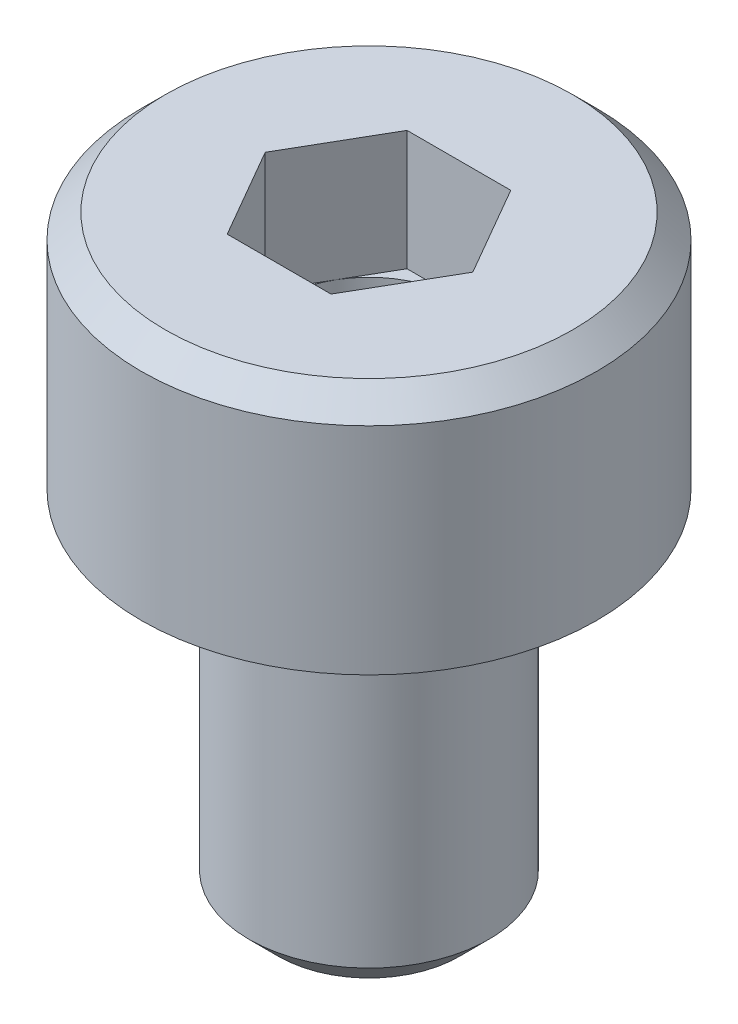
ISO-10303-21;
HEADER;
FILE_DESCRIPTION(('STEP AP214'),'2;1');
FILE_NAME('part.step','',(''),(''),'','','');
FILE_SCHEMA(('AUTOMOTIVE_DESIGN { 1 0 10303 214 1 1 1 1 }'));
ENDSEC;
DATA;
#1=APPLICATION_CONTEXT('core data for automotive mechanical design processes');
#2=APPLICATION_PROTOCOL_DEFINITION('international standard','automotive_design',2000,#1);
#3=PRODUCT_CONTEXT('',#1,'mechanical');
#4=PRODUCT('Part','Part','',(#3));
#5=PRODUCT_RELATED_PRODUCT_CATEGORY('part','',(#4));
#6=PRODUCT_DEFINITION_FORMATION('','',#4);
#7=PRODUCT_DEFINITION_CONTEXT('part definition',#1,'design');
#8=PRODUCT_DEFINITION('design','',#6,#7);
#9=PRODUCT_DEFINITION_SHAPE('','',#8);
#10=(LENGTH_UNIT() NAMED_UNIT(*) SI_UNIT(.MILLI.,.METRE.));
#11=(NAMED_UNIT(*) PLANE_ANGLE_UNIT() SI_UNIT($,.RADIAN.));
#12=(NAMED_UNIT(*) SI_UNIT($,.STERADIAN.) SOLID_ANGLE_UNIT());
#13=UNCERTAINTY_MEASURE_WITH_UNIT(LENGTH_MEASURE(1.E-05),#10,'distance_accuracy_value','');
#14=(GEOMETRIC_REPRESENTATION_CONTEXT(3) GLOBAL_UNCERTAINTY_ASSIGNED_CONTEXT((#13)) GLOBAL_UNIT_ASSIGNED_CONTEXT((#10,
#11,#12)) REPRESENTATION_CONTEXT('',''));
#15=CARTESIAN_POINT('',(0.,0.,0.));
#16=DIRECTION('',(0.,0.,1.));
#17=DIRECTION('',(1.,0.,0.));
#18=AXIS2_PLACEMENT_3D('',#15,#16,#17);
#19=CARTESIAN_POINT('',(0.,0.550000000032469,0.));
#20=DIRECTION('',(0.,1.,0.));
#21=DIRECTION('',(0.,0.,1.));
#22=AXIS2_PLACEMENT_3D('',#19,#20,#21);
#23=CONICAL_SURFACE('',#22,0.750000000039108,1.04719755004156);
#24=CARTESIAN_POINT('',(0.,0.116987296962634,0.));
#25=VERTEX_POINT('',#24);
#26=VERTEX_LOOP('',#25);
#27=FACE_BOUND('',#26,.T.);
#28=CARTESIAN_POINT('',(0.,0.55,0.));
#29=DIRECTION('',(0.,-1.,0.));
#30=DIRECTION('',(0.,0.,-1.));
#31=AXIS2_PLACEMENT_3D('',#28,#29,#30);
#32=CIRCLE('',#31,0.75);
#33=CARTESIAN_POINT('',(0.,0.55,-0.75));
#34=VERTEX_POINT('',#33);
#35=EDGE_CURVE('E98',#34,#34,#32,.F.);
#36=ORIENTED_EDGE('',*,*,#35,.T.);
#37=EDGE_LOOP('',(#36));
#38=FACE_BOUND('',#37,.T.);
#39=ADVANCED_FACE('F16',(#27,#38),#23,.F.);
#40=CARTESIAN_POINT('',(0.,2.,0.));
#41=DIRECTION('',(0.,-1.,0.));
#42=DIRECTION('',(0.,0.,-1.));
#43=AXIS2_PLACEMENT_3D('',#40,#41,#42);
#44=CYLINDRICAL_SURFACE('',#43,0.75);
#45=CARTESIAN_POINT('',(0.,1.,0.));
#46=DIRECTION('',(0.,-1.,0.));
#47=DIRECTION('',(0.,0.,-1.));
#48=AXIS2_PLACEMENT_3D('',#45,#46,#47);
#49=CIRCLE('',#48,0.75);
#50=CARTESIAN_POINT('',(0.,1.,-0.75));
#51=VERTEX_POINT('',#50);
#52=CARTESIAN_POINT('',(-0.649519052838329,1.,-0.375));
#53=VERTEX_POINT('',#52);
#54=EDGE_CURVE('E19',#51,#53,#49,.F.);
#55=ORIENTED_EDGE('',*,*,#54,.T.);
#56=CARTESIAN_POINT('',(0.,1.,0.));
#57=DIRECTION('',(0.,-1.,0.));
#58=DIRECTION('',(0.,0.,-1.));
#59=AXIS2_PLACEMENT_3D('',#56,#57,#58);
#60=CIRCLE('',#59,0.75);
#61=CARTESIAN_POINT('',(-0.649519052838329,1.,0.375));
#62=VERTEX_POINT('',#61);
#63=EDGE_CURVE('E93',#53,#62,#60,.F.);
#64=ORIENTED_EDGE('',*,*,#63,.T.);
#65=CARTESIAN_POINT('',(0.,1.,0.));
#66=DIRECTION('',(0.,-1.,0.));
#67=DIRECTION('',(0.,0.,-1.));
#68=AXIS2_PLACEMENT_3D('',#65,#66,#67);
#69=CIRCLE('',#68,0.75);
#70=CARTESIAN_POINT('',(0.,1.,0.75));
#71=VERTEX_POINT('',#70);
#72=EDGE_CURVE('E109',#62,#71,#69,.F.);
#73=ORIENTED_EDGE('',*,*,#72,.T.);
#74=CARTESIAN_POINT('',(0.,1.,0.));
#75=DIRECTION('',(0.,-1.,0.));
#76=DIRECTION('',(0.,0.,-1.));
#77=AXIS2_PLACEMENT_3D('',#74,#75,#76);
#78=CIRCLE('',#77,0.75);
#79=CARTESIAN_POINT('',(0.649519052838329,1.,0.375));
#80=VERTEX_POINT('',#79);
#81=EDGE_CURVE('E215',#71,#80,#78,.F.);
#82=ORIENTED_EDGE('',*,*,#81,.T.);
#83=CARTESIAN_POINT('',(0.,1.,0.));
#84=DIRECTION('',(0.,-1.,0.));
#85=DIRECTION('',(0.,0.,-1.));
#86=AXIS2_PLACEMENT_3D('',#83,#84,#85);
#87=CIRCLE('',#86,0.75);
#88=CARTESIAN_POINT('',(0.649519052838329,1.,-0.375));
#89=VERTEX_POINT('',#88);
#90=EDGE_CURVE('E217',#80,#89,#87,.F.);
#91=ORIENTED_EDGE('',*,*,#90,.T.);
#92=CARTESIAN_POINT('',(0.,1.,0.));
#93=DIRECTION('',(0.,-1.,0.));
#94=DIRECTION('',(0.,0.,-1.));
#95=AXIS2_PLACEMENT_3D('',#92,#93,#94);
#96=CIRCLE('',#95,0.75);
#97=EDGE_CURVE('E88',#89,#51,#96,.F.);
#98=ORIENTED_EDGE('',*,*,#97,.T.);
#99=EDGE_LOOP('',(#55,#64,#73,#82,#91,#98));
#100=FACE_BOUND('',#99,.T.);
#101=ORIENTED_EDGE('',*,*,#35,.F.);
#102=EDGE_LOOP('',(#101));
#103=FACE_BOUND('',#102,.T.);
#104=ADVANCED_FACE('F91',(#100,#103),#44,.F.);
#105=CARTESIAN_POINT('',(0.,-3.,0.));
#106=DIRECTION('',(0.,-1.,0.));
#107=DIRECTION('',(0.,0.,-1.));
#108=AXIS2_PLACEMENT_3D('',#105,#106,#107);
#109=PLANE('',#108);
#110=CARTESIAN_POINT('',(0.,-2.9999999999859,0.));
#111=DIRECTION('',(0.,1.,0.));
#112=DIRECTION('',(0.,0.,1.));
#113=AXIS2_PLACEMENT_3D('',#110,#111,#112);
#114=CIRCLE('',#113,0.754620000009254);
#115=CARTESIAN_POINT('',(0.,-2.9999999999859,0.754620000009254));
#116=VERTEX_POINT('',#115);
#117=EDGE_CURVE('E108',#116,#116,#114,.T.);
#118=ORIENTED_EDGE('',*,*,#117,.F.);
#119=EDGE_LOOP('',(#118));
#120=FACE_BOUND('',#119,.T.);
#121=ADVANCED_FACE('F430',(#120),#109,.T.);
#122=CARTESIAN_POINT('',(0.,1.,0.));
#123=DIRECTION('',(0.,-1.,0.));
#124=DIRECTION('',(0.,0.,-1.));
#125=AXIS2_PLACEMENT_3D('',#122,#123,#124);
#126=PLANE('',#125);
#127=DIRECTION('',(-0.5,0.,0.866025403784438));
#128=VECTOR('',#127,1.);
#129=CARTESIAN_POINT('',(-0.649519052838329,1.,-0.375));
#130=LINE('',#129,#128);
#131=CARTESIAN_POINT('',(-0.433012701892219,1.,-0.75));
#132=VERTEX_POINT('',#131);
#133=EDGE_CURVE('E112',#132,#53,#130,.T.);
#134=ORIENTED_EDGE('',*,*,#133,.T.);
#135=ORIENTED_EDGE('',*,*,#54,.F.);
#136=DIRECTION('',(-1.,0.,0.));
#137=VECTOR('',#136,1.);
#138=CARTESIAN_POINT('',(0.,1.,-0.75));
#139=LINE('',#138,#137);
#140=EDGE_CURVE('E115',#51,#132,#139,.T.);
#141=ORIENTED_EDGE('',*,*,#140,.T.);
#142=EDGE_LOOP('',(#134,#135,#141));
#143=FACE_BOUND('',#142,.T.);
#144=ADVANCED_FACE('F113',(#143),#126,.F.);
#145=CARTESIAN_POINT('',(0.,1.,0.));
#146=DIRECTION('',(0.,-1.,0.));
#147=DIRECTION('',(0.,0.,-1.));
#148=AXIS2_PLACEMENT_3D('',#145,#146,#147);
#149=PLANE('',#148);
#150=DIRECTION('',(-1.,0.,0.));
#151=VECTOR('',#150,1.);
#152=CARTESIAN_POINT('',(0.,1.,-0.75));
#153=LINE('',#152,#151);
#154=CARTESIAN_POINT('',(0.43301270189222,1.,-0.75));
#155=VERTEX_POINT('',#154);
#156=EDGE_CURVE('E187',#155,#51,#153,.T.);
#157=ORIENTED_EDGE('',*,*,#156,.T.);
#158=ORIENTED_EDGE('',*,*,#97,.F.);
#159=DIRECTION('',(0.5,0.,0.866025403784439));
#160=VECTOR('',#159,1.);
#161=CARTESIAN_POINT('',(0.649519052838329,1.,-0.375));
#162=LINE('',#161,#160);
#163=EDGE_CURVE('E178',#155,#89,#162,.T.);
#164=ORIENTED_EDGE('',*,*,#163,.F.);
#165=EDGE_LOOP('',(#157,#158,#164));
#166=FACE_BOUND('',#165,.T.);
#167=ADVANCED_FACE('F224',(#166),#149,.F.);
#168=CARTESIAN_POINT('',(0.,1.,0.));
#169=DIRECTION('',(0.,-1.,0.));
#170=DIRECTION('',(0.,0.,-1.));
#171=AXIS2_PLACEMENT_3D('',#168,#169,#170);
#172=PLANE('',#171);
#173=DIRECTION('',(0.5,0.,0.866025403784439));
#174=VECTOR('',#173,1.);
#175=CARTESIAN_POINT('',(0.649519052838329,1.,-0.375));
#176=LINE('',#175,#174);
#177=CARTESIAN_POINT('',(0.866025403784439,1.,0.));
#178=VERTEX_POINT('',#177);
#179=EDGE_CURVE('E175',#89,#178,#176,.T.);
#180=ORIENTED_EDGE('',*,*,#179,.F.);
#181=ORIENTED_EDGE('',*,*,#90,.F.);
#182=DIRECTION('',(-0.5,0.,0.866025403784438));
#183=VECTOR('',#182,1.);
#184=CARTESIAN_POINT('',(0.649519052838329,1.,0.375));
#185=LINE('',#184,#183);
#186=EDGE_CURVE('E163',#178,#80,#185,.T.);
#187=ORIENTED_EDGE('',*,*,#186,.F.);
#188=EDGE_LOOP('',(#180,#181,#187));
#189=FACE_BOUND('',#188,.T.);
#190=ADVANCED_FACE('F226',(#189),#172,.F.);
#191=CARTESIAN_POINT('',(0.,1.,0.));
#192=DIRECTION('',(0.,-1.,0.));
#193=DIRECTION('',(0.,0.,-1.));
#194=AXIS2_PLACEMENT_3D('',#191,#192,#193);
#195=PLANE('',#194);
#196=DIRECTION('',(-0.5,0.,0.866025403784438));
#197=VECTOR('',#196,1.);
#198=CARTESIAN_POINT('',(0.649519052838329,1.,0.375));
#199=LINE('',#198,#197);
#200=CARTESIAN_POINT('',(0.433012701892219,1.,0.75));
#201=VERTEX_POINT('',#200);
#202=EDGE_CURVE('E160',#80,#201,#199,.T.);
#203=ORIENTED_EDGE('',*,*,#202,.F.);
#204=ORIENTED_EDGE('',*,*,#81,.F.);
#205=DIRECTION('',(-1.,0.,0.));
#206=VECTOR('',#205,1.);
#207=CARTESIAN_POINT('',(0.,1.,0.75));
#208=LINE('',#207,#206);
#209=EDGE_CURVE('E148',#201,#71,#208,.T.);
#210=ORIENTED_EDGE('',*,*,#209,.F.);
#211=EDGE_LOOP('',(#203,#204,#210));
#212=FACE_BOUND('',#211,.T.);
#213=ADVANCED_FACE('F269',(#212),#195,.F.);
#214=CARTESIAN_POINT('',(0.,1.,0.));
#215=DIRECTION('',(0.,-1.,0.));
#216=DIRECTION('',(0.,0.,-1.));
#217=AXIS2_PLACEMENT_3D('',#214,#215,#216);
#218=PLANE('',#217);
#219=DIRECTION('',(-1.,0.,0.));
#220=VECTOR('',#219,1.);
#221=CARTESIAN_POINT('',(0.,1.,0.75));
#222=LINE('',#221,#220);
#223=CARTESIAN_POINT('',(-0.433012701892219,1.,0.75));
#224=VERTEX_POINT('',#223);
#225=EDGE_CURVE('E145',#71,#224,#222,.T.);
#226=ORIENTED_EDGE('',*,*,#225,.F.);
#227=ORIENTED_EDGE('',*,*,#72,.F.);
#228=DIRECTION('',(0.5,0.,0.866025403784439));
#229=VECTOR('',#228,1.);
#230=CARTESIAN_POINT('',(-0.649519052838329,1.,0.375));
#231=LINE('',#230,#229);
#232=EDGE_CURVE('E152',#62,#224,#231,.T.);
#233=ORIENTED_EDGE('',*,*,#232,.T.);
#234=EDGE_LOOP('',(#226,#227,#233));
#235=FACE_BOUND('',#234,.T.);
#236=ADVANCED_FACE('F266',(#235),#218,.F.);
#237=CARTESIAN_POINT('',(0.,1.,0.));
#238=DIRECTION('',(0.,-1.,0.));
#239=DIRECTION('',(0.,0.,-1.));
#240=AXIS2_PLACEMENT_3D('',#237,#238,#239);
#241=PLANE('',#240);
#242=DIRECTION('',(0.5,0.,0.866025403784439));
#243=VECTOR('',#242,1.);
#244=CARTESIAN_POINT('',(-0.649519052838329,1.,0.375));
#245=LINE('',#244,#243);
#246=CARTESIAN_POINT('',(-0.866025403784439,1.,0.));
#247=VERTEX_POINT('',#246);
#248=EDGE_CURVE('E106',#247,#62,#245,.T.);
#249=ORIENTED_EDGE('',*,*,#248,.T.);
#250=ORIENTED_EDGE('',*,*,#63,.F.);
#251=DIRECTION('',(-0.5,0.,0.866025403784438));
#252=VECTOR('',#251,1.);
#253=CARTESIAN_POINT('',(-0.649519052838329,1.,-0.375));
#254=LINE('',#253,#252);
#255=EDGE_CURVE('E103',#53,#247,#254,.T.);
#256=ORIENTED_EDGE('',*,*,#255,.T.);
#257=EDGE_LOOP('',(#249,#250,#256));
#258=FACE_BOUND('',#257,.T.);
#259=ADVANCED_FACE('F101',(#258),#241,.F.);
#260=CARTESIAN_POINT('',(0.,-2.75461999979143,0.));
#261=DIRECTION('',(0.,1.,0.));
#262=DIRECTION('',(0.,0.,1.));
#263=AXIS2_PLACEMENT_3D('',#260,#261,#262);
#264=CONICAL_SURFACE('',#263,0.999999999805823,0.785398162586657);
#265=ORIENTED_EDGE('',*,*,#117,.T.);
#266=EDGE_LOOP('',(#265));
#267=FACE_BOUND('',#266,.T.);
#268=CARTESIAN_POINT('',(0.,-2.75462,0.));
#269=DIRECTION('',(0.,-1.,0.));
#270=DIRECTION('',(0.,0.,-1.));
#271=AXIS2_PLACEMENT_3D('',#268,#269,#270);
#272=CIRCLE('',#271,1.);
#273=CARTESIAN_POINT('',(0.,-2.75462,-1.));
#274=VERTEX_POINT('',#273);
#275=EDGE_CURVE('E135',#274,#274,#272,.F.);
#276=ORIENTED_EDGE('',*,*,#275,.F.);
#277=EDGE_LOOP('',(#276));
#278=FACE_BOUND('',#277,.T.);
#279=ADVANCED_FACE('F386',(#267,#278),#264,.T.);
#280=CARTESIAN_POINT('',(-0.649519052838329,1.5,-0.375));
#281=DIRECTION('',(-0.866025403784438,0.,-0.5));
#282=DIRECTION('',(-0.5,0.,0.866025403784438));
#283=AXIS2_PLACEMENT_3D('',#280,#281,#282);
#284=PLANE('',#283);
#285=DIRECTION('',(0.,1.,0.));
#286=VECTOR('',#285,1.);
#287=CARTESIAN_POINT('',(-0.433012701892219,2.,-0.75));
#288=LINE('',#287,#286);
#289=CARTESIAN_POINT('',(-0.433012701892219,2.,-0.75));
#290=VERTEX_POINT('',#289);
#291=EDGE_CURVE('E191',#132,#290,#288,.T.);
#292=ORIENTED_EDGE('',*,*,#291,.T.);
#293=DIRECTION('',(0.500000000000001,0.,-0.866025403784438));
#294=VECTOR('',#293,1.);
#295=CARTESIAN_POINT('',(-0.866025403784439,2.,0.));
#296=LINE('',#295,#294);
#297=CARTESIAN_POINT('',(-0.866025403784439,2.,0.));
#298=VERTEX_POINT('',#297);
#299=EDGE_CURVE('E131',#298,#290,#296,.T.);
#300=ORIENTED_EDGE('',*,*,#299,.F.);
#301=DIRECTION('',(0.,1.,0.));
#302=VECTOR('',#301,1.);
#303=CARTESIAN_POINT('',(-0.866025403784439,1.5,0.));
#304=LINE('',#303,#302);
#305=EDGE_CURVE('E121',#298,#247,#304,.F.);
#306=ORIENTED_EDGE('',*,*,#305,.T.);
#307=ORIENTED_EDGE('',*,*,#255,.F.);
#308=ORIENTED_EDGE('',*,*,#133,.F.);
#309=EDGE_LOOP('',(#292,#300,#306,#307,#308));
#310=FACE_BOUND('',#309,.T.);
#311=ADVANCED_FACE('F119',(#310),#284,.F.);
#312=CARTESIAN_POINT('',(0.,2.,-0.75));
#313=DIRECTION('',(0.,0.,-1.));
#314=DIRECTION('',(-1.,0.,0.));
#315=AXIS2_PLACEMENT_3D('',#312,#313,#314);
#316=PLANE('',#315);
#317=DIRECTION('',(0.,1.,0.));
#318=VECTOR('',#317,1.);
#319=CARTESIAN_POINT('',(0.43301270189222,1.5,-0.75));
#320=LINE('',#319,#318);
#321=CARTESIAN_POINT('',(0.43301270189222,2.,-0.75));
#322=VERTEX_POINT('',#321);
#323=EDGE_CURVE('E172',#322,#155,#320,.F.);
#324=ORIENTED_EDGE('',*,*,#323,.F.);
#325=DIRECTION('',(1.,0.,0.));
#326=VECTOR('',#325,1.);
#327=CARTESIAN_POINT('',(0.,2.,-0.75));
#328=LINE('',#327,#326);
#329=EDGE_CURVE('E134',#290,#322,#328,.T.);
#330=ORIENTED_EDGE('',*,*,#329,.F.);
#331=ORIENTED_EDGE('',*,*,#291,.F.);
#332=ORIENTED_EDGE('',*,*,#140,.F.);
#333=ORIENTED_EDGE('',*,*,#156,.F.);
#334=EDGE_LOOP('',(#324,#330,#331,#332,#333));
#335=FACE_BOUND('',#334,.T.);
#336=ADVANCED_FACE('F235',(#335),#316,.F.);
#337=CARTESIAN_POINT('',(0.649519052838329,1.5,-0.375));
#338=DIRECTION('',(-0.866025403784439,0.,0.5));
#339=DIRECTION('',(0.5,0.,0.866025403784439));
#340=AXIS2_PLACEMENT_3D('',#337,#338,#339);
#341=PLANE('',#340);
#342=DIRECTION('',(0.5,0.,0.866025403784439));
#343=VECTOR('',#342,1.);
#344=CARTESIAN_POINT('',(0.43301270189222,2.,-0.75));
#345=LINE('',#344,#343);
#346=CARTESIAN_POINT('',(0.866025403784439,2.,0.));
#347=VERTEX_POINT('',#346);
#348=EDGE_CURVE('E231',#322,#347,#345,.T.);
#349=ORIENTED_EDGE('',*,*,#348,.F.);
#350=ORIENTED_EDGE('',*,*,#323,.T.);
#351=ORIENTED_EDGE('',*,*,#163,.T.);
#352=ORIENTED_EDGE('',*,*,#179,.T.);
#353=DIRECTION('',(0.,1.,0.));
#354=VECTOR('',#353,1.);
#355=CARTESIAN_POINT('',(0.866025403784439,1.5,0.));
#356=LINE('',#355,#354);
#357=EDGE_CURVE('E157',#347,#178,#356,.F.);
#358=ORIENTED_EDGE('',*,*,#357,.F.);
#359=EDGE_LOOP('',(#349,#350,#351,#352,#358));
#360=FACE_BOUND('',#359,.T.);
#361=ADVANCED_FACE('F229',(#360),#341,.T.);
#362=CARTESIAN_POINT('',(0.649519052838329,1.5,0.375));
#363=DIRECTION('',(-0.866025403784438,0.,-0.5));
#364=DIRECTION('',(-0.5,0.,0.866025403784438));
#365=AXIS2_PLACEMENT_3D('',#362,#363,#364);
#366=PLANE('',#365);
#367=DIRECTION('',(-0.500000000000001,0.,0.866025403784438));
#368=VECTOR('',#367,1.);
#369=CARTESIAN_POINT('',(0.866025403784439,2.,0.));
#370=LINE('',#369,#368);
#371=CARTESIAN_POINT('',(0.433012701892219,2.,0.75));
#372=VERTEX_POINT('',#371);
#373=EDGE_CURVE('E244',#347,#372,#370,.T.);
#374=ORIENTED_EDGE('',*,*,#373,.F.);
#375=ORIENTED_EDGE('',*,*,#357,.T.);
#376=ORIENTED_EDGE('',*,*,#186,.T.);
#377=ORIENTED_EDGE('',*,*,#202,.T.);
#378=DIRECTION('',(0.,1.,0.));
#379=VECTOR('',#378,1.);
#380=CARTESIAN_POINT('',(0.433012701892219,2.,0.75));
#381=LINE('',#380,#379);
#382=EDGE_CURVE('E147',#372,#201,#381,.F.);
#383=ORIENTED_EDGE('',*,*,#382,.F.);
#384=EDGE_LOOP('',(#374,#375,#376,#377,#383));
#385=FACE_BOUND('',#384,.T.);
#386=ADVANCED_FACE('F271',(#385),#366,.T.);
#387=CARTESIAN_POINT('',(0.,2.,0.75));
#388=DIRECTION('',(0.,0.,-1.));
#389=DIRECTION('',(-1.,0.,0.));
#390=AXIS2_PLACEMENT_3D('',#387,#388,#389);
#391=PLANE('',#390);
#392=DIRECTION('',(1.,0.,0.));
#393=VECTOR('',#392,1.);
#394=CARTESIAN_POINT('',(0.,2.,0.75));
#395=LINE('',#394,#393);
#396=CARTESIAN_POINT('',(-0.433012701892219,2.,0.75));
#397=VERTEX_POINT('',#396);
#398=EDGE_CURVE('E142',#372,#397,#395,.F.);
#399=ORIENTED_EDGE('',*,*,#398,.F.);
#400=ORIENTED_EDGE('',*,*,#382,.T.);
#401=ORIENTED_EDGE('',*,*,#209,.T.);
#402=ORIENTED_EDGE('',*,*,#225,.T.);
#403=DIRECTION('',(0.,1.,0.));
#404=VECTOR('',#403,1.);
#405=CARTESIAN_POINT('',(-0.433012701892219,1.5,0.75));
#406=LINE('',#405,#404);
#407=EDGE_CURVE('E34',#224,#397,#406,.T.);
#408=ORIENTED_EDGE('',*,*,#407,.T.);
#409=EDGE_LOOP('',(#399,#400,#401,#402,#408));
#410=FACE_BOUND('',#409,.T.);
#411=ADVANCED_FACE('F267',(#410),#391,.T.);
#412=CARTESIAN_POINT('',(-0.649519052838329,1.5,0.375));
#413=DIRECTION('',(-0.866025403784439,0.,0.5));
#414=DIRECTION('',(0.5,0.,0.866025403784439));
#415=AXIS2_PLACEMENT_3D('',#412,#413,#414);
#416=PLANE('',#415);
#417=ORIENTED_EDGE('',*,*,#305,.F.);
#418=DIRECTION('',(-0.500000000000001,0.,-0.866025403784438));
#419=VECTOR('',#418,1.);
#420=CARTESIAN_POINT('',(-0.433012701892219,2.,0.75));
#421=LINE('',#420,#419);
#422=EDGE_CURVE('E138',#397,#298,#421,.T.);
#423=ORIENTED_EDGE('',*,*,#422,.F.);
#424=ORIENTED_EDGE('',*,*,#407,.F.);
#425=ORIENTED_EDGE('',*,*,#232,.F.);
#426=ORIENTED_EDGE('',*,*,#248,.F.);
#427=EDGE_LOOP('',(#417,#423,#424,#425,#426));
#428=FACE_BOUND('',#427,.T.);
#429=ADVANCED_FACE('F238',(#428),#416,.F.);
#430=CARTESIAN_POINT('',(0.,0.,0.));
#431=DIRECTION('',(0.,-1.,0.));
#432=DIRECTION('',(0.,0.,-1.));
#433=AXIS2_PLACEMENT_3D('',#430,#431,#432);
#434=CYLINDRICAL_SURFACE('',#433,1.);
#435=CARTESIAN_POINT('',(0.,-0.1,0.));
#436=DIRECTION('',(0.,-1.,0.));
#437=DIRECTION('',(0.,0.,1.));
#438=AXIS2_PLACEMENT_3D('',#435,#436,#437);
#439=CIRCLE('',#438,1.);
#440=CARTESIAN_POINT('',(0.,-0.1,1.));
#441=VERTEX_POINT('',#440);
#442=EDGE_CURVE('E141',#441,#441,#439,.T.);
#443=ORIENTED_EDGE('',*,*,#442,.T.);
#444=EDGE_LOOP('',(#443));
#445=FACE_BOUND('',#444,.T.);
#446=ORIENTED_EDGE('',*,*,#275,.T.);
#447=EDGE_LOOP('',(#446));
#448=FACE_BOUND('',#447,.T.);
#449=ADVANCED_FACE('F317',(#445,#448),#434,.T.);
#450=CARTESIAN_POINT('',(0.,2.,0.));
#451=DIRECTION('',(0.,1.,0.));
#452=DIRECTION('',(0.,0.,1.));
#453=AXIS2_PLACEMENT_3D('',#450,#451,#452);
#454=PLANE('',#453);
#455=ORIENTED_EDGE('',*,*,#398,.T.);
#456=ORIENTED_EDGE('',*,*,#422,.T.);
#457=ORIENTED_EDGE('',*,*,#299,.T.);
#458=ORIENTED_EDGE('',*,*,#329,.T.);
#459=ORIENTED_EDGE('',*,*,#348,.T.);
#460=ORIENTED_EDGE('',*,*,#373,.T.);
#461=EDGE_LOOP('',(#455,#456,#457,#458,#459,#460));
#462=FACE_BOUND('',#461,.T.);
#463=CARTESIAN_POINT('',(0.,2.00000000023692,0.));
#464=DIRECTION('',(0.,-1.,0.));
#465=DIRECTION('',(0.,0.,-1.));
#466=AXIS2_PLACEMENT_3D('',#463,#464,#465);
#467=CIRCLE('',#466,1.7000000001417);
#468=CARTESIAN_POINT('',(0.,2.00000000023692,-1.7000000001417));
#469=VERTEX_POINT('',#468);
#470=EDGE_CURVE('E210',#469,#469,#467,.T.);
#471=ORIENTED_EDGE('',*,*,#470,.F.);
#472=EDGE_LOOP('',(#471));
#473=FACE_BOUND('',#472,.T.);
#474=ADVANCED_FACE('F240',(#462,#473),#454,.T.);
#475=CARTESIAN_POINT('',(0.,-0.1,0.));
#476=DIRECTION('',(0.,-1.,0.));
#477=DIRECTION('',(0.,0.,1.));
#478=AXIS2_PLACEMENT_3D('',#475,#476,#477);
#479=TOROIDAL_SURFACE('',#478,1.1,0.1);
#480=ORIENTED_EDGE('',*,*,#442,.F.);
#481=EDGE_LOOP('',(#480));
#482=FACE_BOUND('',#481,.T.);
#483=CARTESIAN_POINT('',(0.,0.,0.));
#484=DIRECTION('',(0.,-1.,0.));
#485=DIRECTION('',(0.,0.,-1.));
#486=AXIS2_PLACEMENT_3D('',#483,#484,#485);
#487=CIRCLE('',#486,1.1);
#488=CARTESIAN_POINT('',(0.,0.,-1.1));
#489=VERTEX_POINT('',#488);
#490=EDGE_CURVE('E212',#489,#489,#487,.F.);
#491=ORIENTED_EDGE('',*,*,#490,.F.);
#492=EDGE_LOOP('',(#491));
#493=FACE_BOUND('',#492,.T.);
#494=ADVANCED_FACE('F310',(#482,#493),#479,.F.);
#495=CARTESIAN_POINT('',(0.,1.80000000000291,0.));
#496=DIRECTION('',(0.,-1.,0.));
#497=DIRECTION('',(0.,0.,-1.));
#498=AXIS2_PLACEMENT_3D('',#495,#496,#497);
#499=CONICAL_SURFACE('',#498,1.90000000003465,0.785398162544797);
#500=CARTESIAN_POINT('',(0.,1.8,0.));
#501=DIRECTION('',(0.,1.,0.));
#502=DIRECTION('',(0.,0.,1.));
#503=AXIS2_PLACEMENT_3D('',#500,#501,#502);
#504=CIRCLE('',#503,1.9);
#505=CARTESIAN_POINT('',(0.,1.8,1.9));
#506=VERTEX_POINT('',#505);
#507=EDGE_CURVE('E25',#506,#506,#504,.F.);
#508=ORIENTED_EDGE('',*,*,#507,.F.);
#509=EDGE_LOOP('',(#508));
#510=FACE_BOUND('',#509,.T.);
#511=ORIENTED_EDGE('',*,*,#470,.T.);
#512=EDGE_LOOP('',(#511));
#513=FACE_BOUND('',#512,.T.);
#514=ADVANCED_FACE('F289',(#510,#513),#499,.T.);
#515=CARTESIAN_POINT('',(0.,0.,0.));
#516=DIRECTION('',(0.,-1.,0.));
#517=DIRECTION('',(0.,0.,-1.));
#518=AXIS2_PLACEMENT_3D('',#515,#516,#517);
#519=PLANE('',#518);
#520=CARTESIAN_POINT('',(0.,0.,0.));
#521=DIRECTION('',(0.,1.,0.));
#522=DIRECTION('',(0.,0.,1.));
#523=AXIS2_PLACEMENT_3D('',#520,#521,#522);
#524=CIRCLE('',#523,1.9);
#525=CARTESIAN_POINT('',(0.,0.,1.9));
#526=VERTEX_POINT('',#525);
#527=EDGE_CURVE('E11',#526,#526,#524,.T.);
#528=ORIENTED_EDGE('',*,*,#527,.F.);
#529=EDGE_LOOP('',(#528));
#530=FACE_BOUND('',#529,.T.);
#531=ORIENTED_EDGE('',*,*,#490,.T.);
#532=EDGE_LOOP('',(#531));
#533=FACE_BOUND('',#532,.T.);
#534=ADVANCED_FACE('F283',(#530,#533),#519,.T.);
#535=CARTESIAN_POINT('',(0.,0.,0.));
#536=DIRECTION('',(0.,1.,0.));
#537=DIRECTION('',(0.,0.,1.));
#538=AXIS2_PLACEMENT_3D('',#535,#536,#537);
#539=CYLINDRICAL_SURFACE('',#538,1.9);
#540=ORIENTED_EDGE('',*,*,#527,.T.);
#541=EDGE_LOOP('',(#540));
#542=FACE_BOUND('',#541,.T.);
#543=ORIENTED_EDGE('',*,*,#507,.T.);
#544=EDGE_LOOP('',(#543));
#545=FACE_BOUND('',#544,.T.);
#546=ADVANCED_FACE('F281',(#542,#545),#539,.T.);
#547=CLOSED_SHELL('',(#39,#104,#121,#144,#167,#190,#213,#236,#259,#279,#311,#336,#361,#386,#411,
#429,#449,#474,#494,#514,#534,#546));
#548=MANIFOLD_SOLID_BREP('B1',#547);
#549=ADVANCED_BREP_SHAPE_REPRESENTATION('',(#18,#548),#14);
#550=SHAPE_DEFINITION_REPRESENTATION(#9,#549);
ENDSEC;
END-ISO-10303-21;
